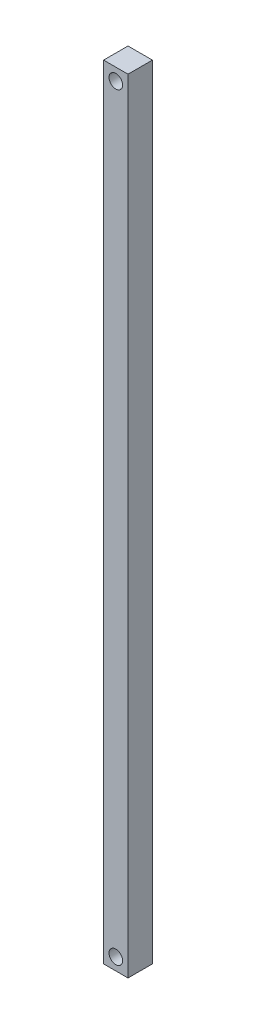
from build123d import *

# Parameters (mm, degrees)
SKETCH1_W           = 18.7
SKETCH1_H           = 600
SKETCH1_R           = 5.2
BOSS_EXTRUDE1_DEPTH = 18.7


with BuildPart() as part:
    # Sketch1 → Boss-Extrude1 (new body)
    with BuildSketch(Plane.XY):
        with Locations((5.58034328, 300)):
            Rectangle(SKETCH1_W, SKETCH1_H)
        with Locations((5.58034328, 590.65)):
            Circle(SKETCH1_R, mode=Mode.SUBTRACT)
        with Locations((5.58034328, 9.35)):
            Circle(SKETCH1_R, mode=Mode.SUBTRACT)
    extrude(amount=BOSS_EXTRUDE1_DEPTH)


solid = part.part
